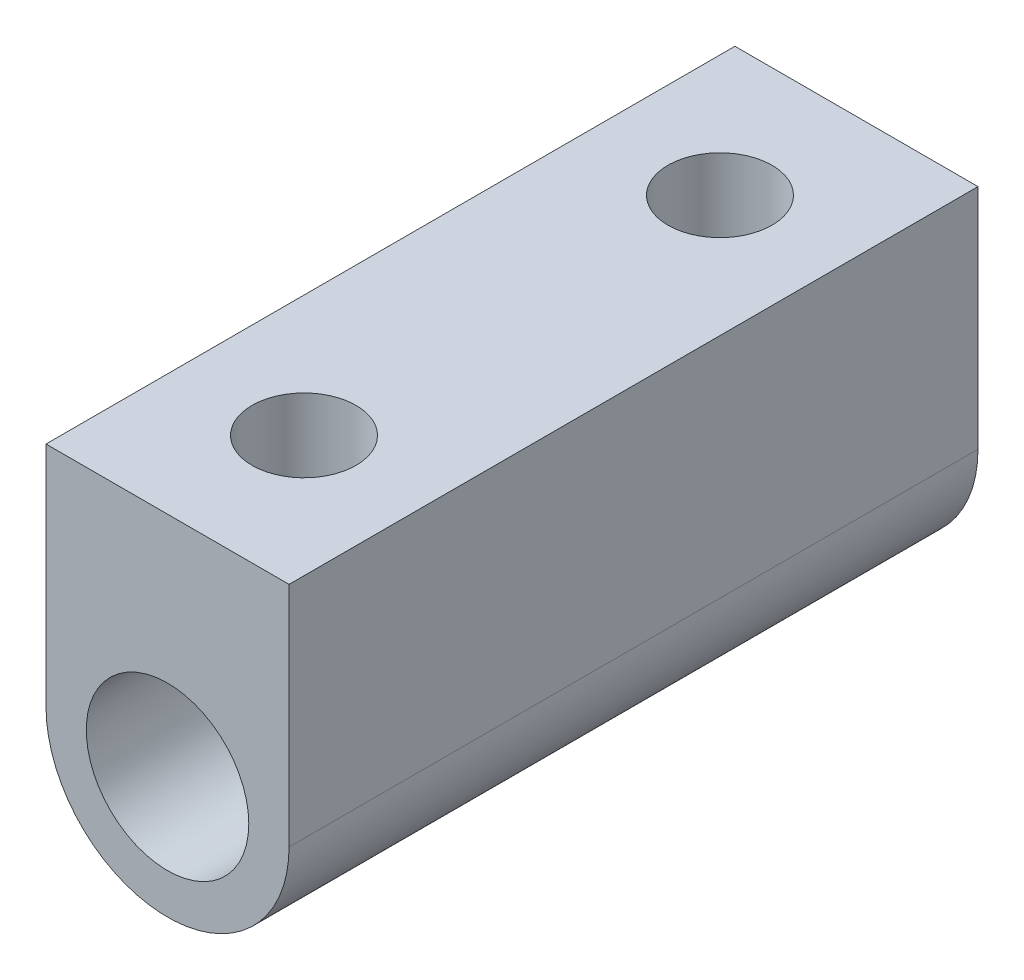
from build123d import *

# Parameters (mm, degrees)
BOSS_EXTRU_1_DEPTH           = 5.3
BOSS_EXTRU_1_DEPTH_BACK      = 5.3
ENL_V_MAT_EXTRU_1_DEPTH      = 7.620944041
ENL_V_MAT_EXTRU_1_DEPTH_BACK = 7.620944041
ESQUISSE2_R                  = 1.25
TROU_TARAUD_M21_REACH        = 9.773
TROU_TARAUD_M21_BORE_R       = 0.8


with BuildPart() as part:
    # Esquisse1 → Boss.-Extru.1 (new, two sides: drawn at the far end of the back side and taken through both)
    with BuildSketch(Plane.XY.offset(-BOSS_EXTRU_1_DEPTH_BACK)):
        with BuildLine():
            Line((-1.87, 3.5), (-1.87, 0))
            ThreePointArc((-1.87, 0), (0, -1.87), (1.87, 0))
            Line((1.87, 0), (1.87, 3.5))
            Line((1.87, 3.5), (-1.87, 3.5))
        make_face()
    extrude(amount=BOSS_EXTRU_1_DEPTH + BOSS_EXTRU_1_DEPTH_BACK)

    # Esquisse2 → Enl_v. mat.-Extru.1 (cut, two sides: drawn at the far end of the back side and taken through both)
    with BuildSketch(Plane.XY.offset(-ENL_V_MAT_EXTRU_1_DEPTH_BACK)):
        Circle(ESQUISSE2_R)
    extrude(amount=ENL_V_MAT_EXTRU_1_DEPTH + ENL_V_MAT_EXTRU_1_DEPTH_BACK, mode=Mode.SUBTRACT)

    # Trou taraud_ M21 bore → Trou taraud_ M21 (cut, up to next)
    with BuildSketch(Plane(origin=(0, 3.5, 0), x_dir=(1, 0, 0), z_dir=(0, 1, 0)), mode=Mode.PRIVATE) as trou_taraud_m21_sk1:
        with Locations((0, -3.2)):
            Circle(TROU_TARAUD_M21_BORE_R)
    trou_taraud_m21_tool1 = extrude(trou_taraud_m21_sk1.sketch, amount=-TROU_TARAUD_M21_REACH, mode=Mode.PRIVATE) & part.part
    # Trou taraud_ M21 bore → Trou taraud_ M21 (cut, up to next)
    with BuildSketch(Plane(origin=(0, 3.5, 0), x_dir=(1, 0, 0), z_dir=(0, 1, 0)), mode=Mode.PRIVATE) as trou_taraud_m21_sk2:
        with Locations((0, 3.2)):
            Circle(TROU_TARAUD_M21_BORE_R)
    trou_taraud_m21_tool2 = extrude(trou_taraud_m21_sk2.sketch, amount=-TROU_TARAUD_M21_REACH, mode=Mode.PRIVATE) & part.part
    add(trou_taraud_m21_tool1.solids().sort_by_distance((0, 3.5, 3.2))[0], mode=Mode.SUBTRACT)
    add(trou_taraud_m21_tool2.solids().sort_by_distance((0, 3.5, -3.2))[0], mode=Mode.SUBTRACT)


solid = part.part
